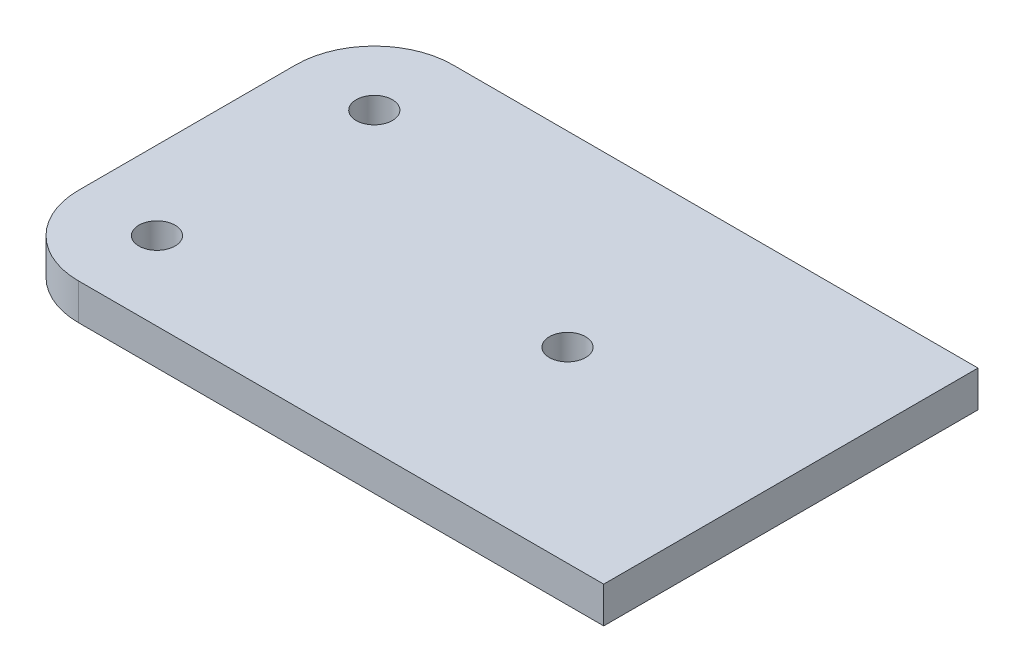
from build123d import *

# Parameters (mm, degrees)
SKETCH1_R      = 3
EXTRUDE1_DEPTH = 6


with BuildPart() as part:
    # Sketch1 → Extrude1 (new body)
    with BuildSketch(Plane(origin=(0, 0, 0), x_dir=(1, 0, 0), z_dir=(0, 1, 0))):
        with BuildLine():
            Line((13, 0), (100, 0))
            Line((100, 0), (100, 62))
            Line((100, 62), (13, 62))
            ThreePointArc((13, 62), (3.807611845, 58.192388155), (0, 49))
            Line((0, 49), (0, 13))
            ThreePointArc((0, 13), (3.807611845, 3.807611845), (13, 0))
        make_face()
        with Locations(Location((13, 49, 0), (0, 0, 270))):
            Circle(SKETCH1_R, mode=Mode.SUBTRACT)
        with Locations(Location((13, 13, 0), (0, 0, 270))):
            Circle(SKETCH1_R, mode=Mode.SUBTRACT)
        with Locations(Location((63, 31, 0), (0, 0, 270))):
            Circle(SKETCH1_R, mode=Mode.SUBTRACT)
    extrude(amount=EXTRUDE1_DEPTH)


solid = part.part
